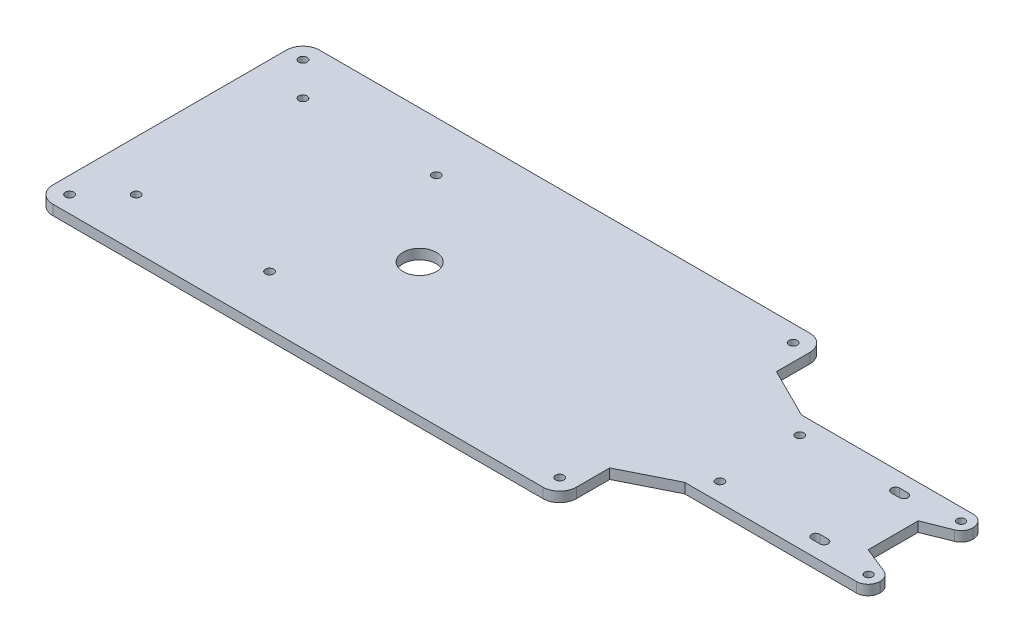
from build123d import *

# Parameters (mm, degrees)
SKETCH1_R               = 1.2
BOSS_EXTRUDE1_DEPTH     = 3
FILLET1_R               = 5
CUT_EXTRUDE1_DEPTH      = 231.516810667
CUT_EXTRUDE1_DEPTH_BACK = 231.516810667
SKETCH2_R               = 1.25
SKETCH3_R               = 1.25
CUT_EXTRUDE2_DEPTH      = 10
SKETCH4_R               = 1.25
CUT_EXTRUDE3_DEPTH      = 10
SKETCH5_R               = 5
CUT_EXTRUDE4_DEPTH      = 10


with BuildPart() as part:
    # Sketch1 → Boss-Extrude1 (new body)
    with BuildSketch(Plane(origin=(0, 0, 0), x_dir=(1, 0, 0), z_dir=(0, 1, 0))):
        with BuildLine():
            Line((0, -30), (0, 30))
            Line((0, 30), (0, 40))
            Line((0, 40), (77, 40))
            Line((77, 40), (157, 40))
            Line((157, 40), (157, 25))
            Line((157, 25), (172, 17.5))
            Line((172, 17.5), (223.5, 17.5))
            ThreePointArc((223.5, 17.5), (225.974873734, 16.474873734), (227, 14))
            Line((227, 14), (227, 13.869615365))
            ThreePointArc((227, 13.869615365), (226.398235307, 11.907414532), (224.799867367, 10.619946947))
            Line((224.799867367, 10.619946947), (217, 7.5))
            Line((217, 7.5), (217, -7.5))
            Line((217, -7.5), (224.799867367, -10.619946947))
            ThreePointArc((224.799867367, -10.619946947), (226.398235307, -11.907414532), (227, -13.869615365))
            Line((227, -13.869615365), (227, -14))
            ThreePointArc((227, -14), (225.974873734, -16.474873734), (223.5, -17.5))
            Line((223.5, -17.5), (172, -17.5))
            Line((172, -17.5), (157, -25))
            Line((157, -25), (157, -40))
            Line((157, -40), (77, -40))
            Line((77, -40), (0, -40))
            Line((0, -40), (0, -30))
        make_face()
        with Locations(Location((223.5, -13.869615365, 0), (0, 0, 90))):
            Circle(SKETCH1_R, mode=Mode.SUBTRACT)
        with Locations(Location((223.5, 13.869615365, 0), (0, 0, 270))):
            Circle(SKETCH1_R, mode=Mode.SUBTRACT)
    extrude(amount=BOSS_EXTRUDE1_DEPTH)

    # Fillet1
    fillet1_edges = [part.edges().sort_by_distance(p)[0] for p in [
        (157, 1.5, 40),
        (0, 1.5, 40),
        (0, 1.5, -40),
        (157, 1.5, -40),
    ]]
    fillet(fillet1_edges, radius=FILLET1_R)

    # Sketch2 → Cut-Extrude1 (cut, two sides: drawn at the far end of the back side and taken through both)
    with BuildSketch(Plane(origin=(0, 3, 0), x_dir=(1, 0, 0), z_dir=(0, 1, 0)).offset(-CUT_EXTRUDE1_DEPTH_BACK)):
        with Locations(Location((15, 25, 0), (0, 0, 270))):
            Circle(SKETCH2_R)
        with Locations(Location((55, 25, 0), (0, 0, 270))):
            Circle(SKETCH2_R)
        with Locations(Location((55, -25, 0), (0, 0, 270))):
            Circle(SKETCH2_R)
        with Locations(Location((15, -25, 0), (0, 0, 270))):
            Circle(SKETCH2_R)
    extrude(amount=CUT_EXTRUDE1_DEPTH + CUT_EXTRUDE1_DEPTH_BACK, mode=Mode.SUBTRACT)

    # Sketch3 → Cut-Extrude2 (cut)
    with BuildSketch(Plane(origin=(0, 3, 0), x_dir=(1, 0, 0), z_dir=(0, 1, 0))):
        with Locations(Location((5, 35, 0), (0, 0, 270))):
            Circle(SKETCH3_R)
        with Locations(Location((5, -35, 0), (0, 0, 270))):
            Circle(SKETCH3_R)
        with Locations(Location((152, 35, 0), (0, 0, 270))):
            Circle(SKETCH3_R)
        with Locations(Location((152, -35, 0), (0, 0, 270))):
            Circle(SKETCH3_R)
    extrude(amount=-CUT_EXTRUDE2_DEPTH, mode=Mode.SUBTRACT)

    # Sketch4 → Cut-Extrude3 (cut)
    with BuildSketch(Plane(origin=(0, 3, 0), x_dir=(1, 0, 0), z_dir=(0, 1, 0))):
        with Locations(Location((177.024019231, 11.975, 0), (0, 0, 270))):
            Circle(SKETCH4_R)
        with Locations(Location((177.024019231, -11.975, 0), (0, 0, 270))):
            Circle(SKETCH4_R)
        with BuildLine():
            Line((205.725980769, 13.225), (208.225980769, 13.225))
            ThreePointArc((208.225980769, 13.225), (209.475980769, 11.975), (208.225980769, 10.725))
            Line((208.225980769, 10.725), (205.725980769, 10.725))
            ThreePointArc((205.725980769, 10.725), (204.475980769, 11.975), (205.725980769, 13.225))
        make_face()
        with BuildLine():
            Line((205.725980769, -10.725), (208.225980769, -10.725))
            ThreePointArc((208.225980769, -10.725), (209.475980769, -11.975), (208.225980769, -13.225))
            Line((208.225980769, -13.225), (205.725980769, -13.225))
            ThreePointArc((205.725980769, -13.225), (204.475980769, -11.975), (205.725980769, -10.725))
        make_face()
    extrude(amount=-CUT_EXTRUDE3_DEPTH, mode=Mode.SUBTRACT)

    # Sketch5 → Cut-Extrude4 (cut)
    with BuildSketch(Plane(origin=(0, 3, 0), x_dir=(1, 0, 0), z_dir=(0, 1, 0))):
        with Locations(Location((75, 0, 0), (0, 0, 270))):
            Circle(SKETCH5_R)
    extrude(amount=-CUT_EXTRUDE4_DEPTH, mode=Mode.SUBTRACT)


solid = part.part
